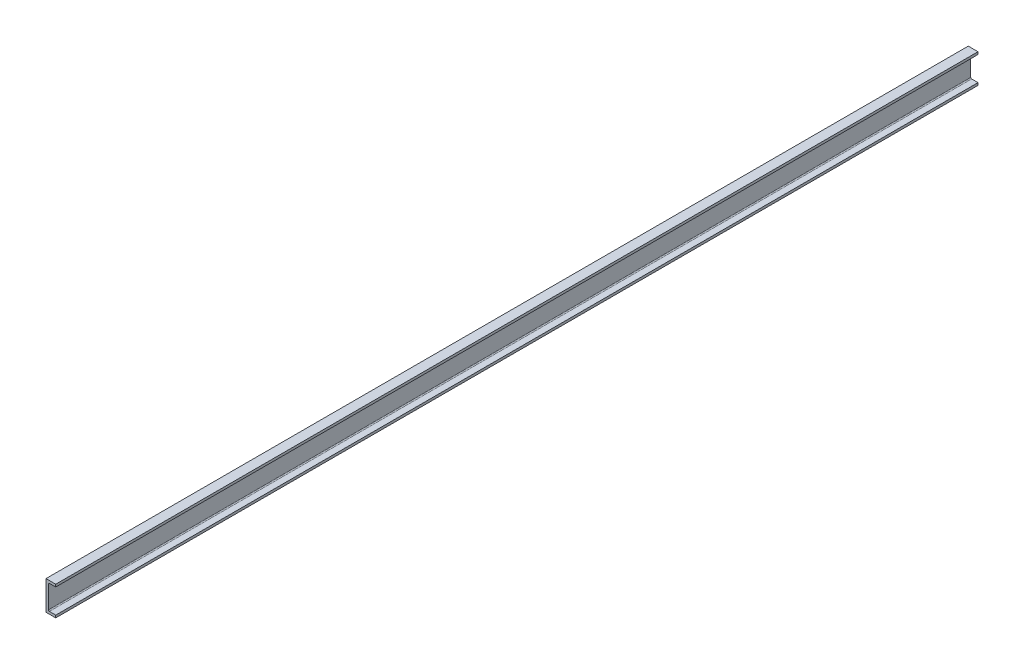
from build123d import *

# Parameters (mm, degrees)
BOSS_EXTRUDE1_DEPTH = 2406.65
FILLET1_R           = 2.54


with BuildPart() as part:
    # Sketch1 → Boss-Extrude1 (new body)
    with BuildSketch(Plane.XY):
        Polygon((0, 0), (0, 76.2), (25.4, 76.2), (25.4, 69.85), (6.35, 69.85), (6.35, 6.35), (25.4, 6.35), (25.4, 0), align=None)
    extrude(amount=-BOSS_EXTRUDE1_DEPTH)

    # Fillet1
    fillet1_edges = [part.edges().sort_by_distance(p)[0] for p in [
        (6.35, 69.85, -1203.325),
        (6.35, 6.35, -1203.325),
    ]]
    fillet(fillet1_edges, radius=FILLET1_R)


solid = part.part
